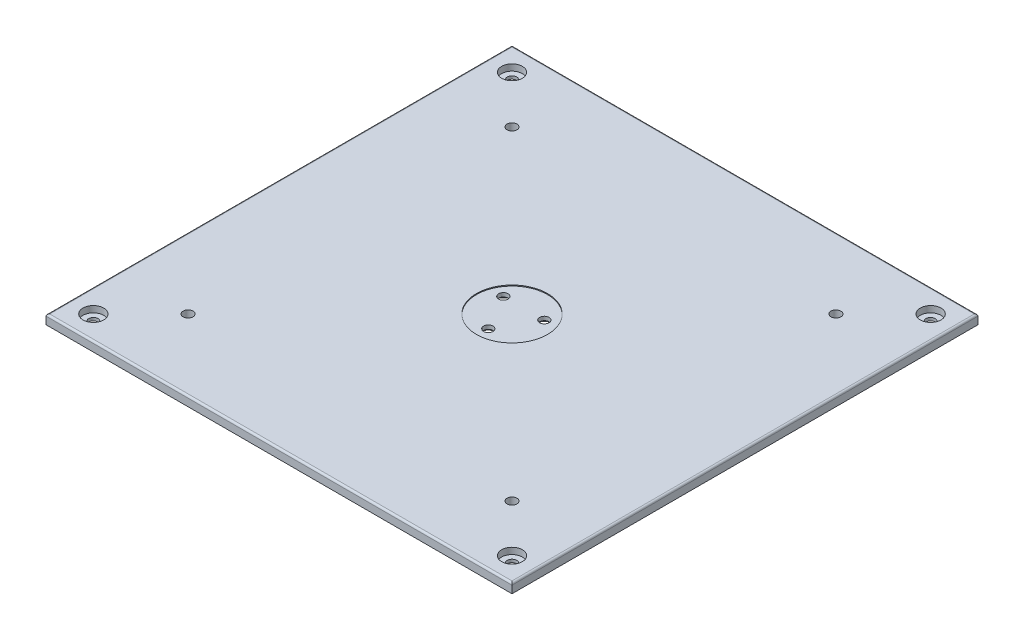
ISO-10303-21;
HEADER;
FILE_DESCRIPTION(('STEP AP214'),'2;1');
FILE_NAME('part.step','',(''),(''),'','','');
FILE_SCHEMA(('AUTOMOTIVE_DESIGN { 1 0 10303 214 1 1 1 1 }'));
ENDSEC;
DATA;
#1=APPLICATION_CONTEXT('core data for automotive mechanical design processes');
#2=APPLICATION_PROTOCOL_DEFINITION('international standard','automotive_design',2000,#1);
#3=PRODUCT_CONTEXT('',#1,'mechanical');
#4=PRODUCT('Part','Part','',(#3));
#5=PRODUCT_RELATED_PRODUCT_CATEGORY('part','',(#4));
#6=PRODUCT_DEFINITION_FORMATION('','',#4);
#7=PRODUCT_DEFINITION_CONTEXT('part definition',#1,'design');
#8=PRODUCT_DEFINITION('design','',#6,#7);
#9=PRODUCT_DEFINITION_SHAPE('','',#8);
#10=(LENGTH_UNIT() NAMED_UNIT(*) SI_UNIT(.MILLI.,.METRE.));
#11=(NAMED_UNIT(*) PLANE_ANGLE_UNIT() SI_UNIT($,.RADIAN.));
#12=(NAMED_UNIT(*) SI_UNIT($,.STERADIAN.) SOLID_ANGLE_UNIT());
#13=UNCERTAINTY_MEASURE_WITH_UNIT(LENGTH_MEASURE(1.E-05),#10,'distance_accuracy_value','');
#14=(GEOMETRIC_REPRESENTATION_CONTEXT(3) GLOBAL_UNCERTAINTY_ASSIGNED_CONTEXT((#13)) GLOBAL_UNIT_ASSIGNED_CONTEXT((#10,
#11,#12)) REPRESENTATION_CONTEXT('',''));
#15=CARTESIAN_POINT('',(0.,0.,0.));
#16=DIRECTION('',(0.,0.,1.));
#17=DIRECTION('',(1.,0.,0.));
#18=AXIS2_PLACEMENT_3D('',#15,#16,#17);
#19=CARTESIAN_POINT('',(-36.835700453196,10.,-26.4724532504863));
#20=DIRECTION('',(1.,0.,0.));
#21=DIRECTION('',(0.,0.,-1.));
#22=AXIS2_PLACEMENT_3D('',#19,#20,#21);
#23=PLANE('',#22);
#24=DIRECTION('',(0.,-1.,0.));
#25=VECTOR('',#24,1.);
#26=CARTESIAN_POINT('',(-36.8357004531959,10.,473.527546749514));
#27=LINE('',#26,#25);
#28=CARTESIAN_POINT('',(-36.8357004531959,8.,473.527546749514));
#29=VERTEX_POINT('',#28);
#30=CARTESIAN_POINT('',(-36.8357004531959,0.,473.527546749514));
#31=VERTEX_POINT('',#30);
#32=EDGE_CURVE('E88',#29,#31,#27,.T.);
#33=ORIENTED_EDGE('',*,*,#32,.F.);
#34=DIRECTION('',(0.,0.,1.));
#35=VECTOR('',#34,1.);
#36=CARTESIAN_POINT('',(-36.835700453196,8.,-26.4724532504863));
#37=LINE('',#36,#35);
#38=CARTESIAN_POINT('',(-36.835700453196,8.,-26.4724532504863));
#39=VERTEX_POINT('',#38);
#40=EDGE_CURVE('E135',#29,#39,#37,.F.);
#41=ORIENTED_EDGE('',*,*,#40,.T.);
#42=DIRECTION('',(0.,-1.,0.));
#43=VECTOR('',#42,1.);
#44=CARTESIAN_POINT('',(-36.835700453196,10.,-26.4724532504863));
#45=LINE('',#44,#43);
#46=CARTESIAN_POINT('',(-36.835700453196,0.,-26.4724532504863));
#47=VERTEX_POINT('',#46);
#48=EDGE_CURVE('E109',#39,#47,#45,.T.);
#49=ORIENTED_EDGE('',*,*,#48,.T.);
#50=DIRECTION('',(0.,0.,1.));
#51=VECTOR('',#50,1.);
#52=CARTESIAN_POINT('',(-36.835700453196,0.,-26.4724532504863));
#53=LINE('',#52,#51);
#54=EDGE_CURVE('E105',#47,#31,#53,.T.);
#55=ORIENTED_EDGE('',*,*,#54,.T.);
#56=EDGE_LOOP('',(#33,#41,#49,#55));
#57=FACE_BOUND('',#56,.T.);
#58=ADVANCED_FACE('F34',(#57),#23,.F.);
#59=CARTESIAN_POINT('',(-36.8357004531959,10.,473.527546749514));
#60=DIRECTION('',(0.,0.,-1.));
#61=DIRECTION('',(-1.,0.,0.));
#62=AXIS2_PLACEMENT_3D('',#59,#60,#61);
#63=PLANE('',#62);
#64=DIRECTION('',(0.,-1.,0.));
#65=VECTOR('',#64,1.);
#66=CARTESIAN_POINT('',(463.164299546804,10.,473.527546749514));
#67=LINE('',#66,#65);
#68=CARTESIAN_POINT('',(463.164299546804,8.,473.527546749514));
#69=VERTEX_POINT('',#68);
#70=CARTESIAN_POINT('',(463.164299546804,0.,473.527546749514));
#71=VERTEX_POINT('',#70);
#72=EDGE_CURVE('E99',#69,#71,#67,.T.);
#73=ORIENTED_EDGE('',*,*,#72,.F.);
#74=DIRECTION('',(1.,0.,0.));
#75=VECTOR('',#74,1.);
#76=CARTESIAN_POINT('',(-36.8357004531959,8.,473.527546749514));
#77=LINE('',#76,#75);
#78=EDGE_CURVE('E11',#69,#29,#77,.F.);
#79=ORIENTED_EDGE('',*,*,#78,.T.);
#80=ORIENTED_EDGE('',*,*,#32,.T.);
#81=DIRECTION('',(1.,0.,0.));
#82=VECTOR('',#81,1.);
#83=CARTESIAN_POINT('',(-36.8357004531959,0.,473.527546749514));
#84=LINE('',#83,#82);
#85=EDGE_CURVE('E91',#31,#71,#84,.T.);
#86=ORIENTED_EDGE('',*,*,#85,.T.);
#87=EDGE_LOOP('',(#73,#79,#80,#86));
#88=FACE_BOUND('',#87,.T.);
#89=ADVANCED_FACE('F90',(#88),#63,.F.);
#90=CARTESIAN_POINT('',(463.164299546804,10.,-26.4724532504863));
#91=DIRECTION('',(-1.,0.,0.));
#92=DIRECTION('',(0.,0.,1.));
#93=AXIS2_PLACEMENT_3D('',#90,#91,#92);
#94=PLANE('',#93);
#95=DIRECTION('',(0.,-1.,0.));
#96=VECTOR('',#95,1.);
#97=CARTESIAN_POINT('',(463.164299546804,10.,-26.4724532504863));
#98=LINE('',#97,#96);
#99=CARTESIAN_POINT('',(463.164299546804,8.,-26.4724532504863));
#100=VERTEX_POINT('',#99);
#101=CARTESIAN_POINT('',(463.164299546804,0.,-26.4724532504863));
#102=VERTEX_POINT('',#101);
#103=EDGE_CURVE('E124',#100,#102,#98,.T.);
#104=ORIENTED_EDGE('',*,*,#103,.F.);
#105=DIRECTION('',(0.,0.,-1.));
#106=VECTOR('',#105,1.);
#107=CARTESIAN_POINT('',(463.164299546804,8.,473.527546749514));
#108=LINE('',#107,#106);
#109=EDGE_CURVE('E43',#100,#69,#108,.F.);
#110=ORIENTED_EDGE('',*,*,#109,.T.);
#111=ORIENTED_EDGE('',*,*,#72,.T.);
#112=DIRECTION('',(0.,0.,-1.));
#113=VECTOR('',#112,1.);
#114=CARTESIAN_POINT('',(463.164299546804,0.,-26.4724532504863));
#115=LINE('',#114,#113);
#116=EDGE_CURVE('E107',#71,#102,#115,.T.);
#117=ORIENTED_EDGE('',*,*,#116,.T.);
#118=EDGE_LOOP('',(#104,#110,#111,#117));
#119=FACE_BOUND('',#118,.T.);
#120=ADVANCED_FACE('F208',(#119),#94,.F.);
#121=CARTESIAN_POINT('',(-36.835700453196,10.,-26.4724532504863));
#122=DIRECTION('',(0.,0.,1.));
#123=DIRECTION('',(1.,0.,0.));
#124=AXIS2_PLACEMENT_3D('',#121,#122,#123);
#125=PLANE('',#124);
#126=ORIENTED_EDGE('',*,*,#48,.F.);
#127=DIRECTION('',(-1.,0.,0.));
#128=VECTOR('',#127,1.);
#129=CARTESIAN_POINT('',(463.164299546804,8.,-26.4724532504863));
#130=LINE('',#129,#128);
#131=EDGE_CURVE('E58',#39,#100,#130,.F.);
#132=ORIENTED_EDGE('',*,*,#131,.T.);
#133=ORIENTED_EDGE('',*,*,#103,.T.);
#134=DIRECTION('',(-1.,0.,0.));
#135=VECTOR('',#134,1.);
#136=CARTESIAN_POINT('',(-36.835700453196,0.,-26.4724532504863));
#137=LINE('',#136,#135);
#138=EDGE_CURVE('E121',#102,#47,#137,.T.);
#139=ORIENTED_EDGE('',*,*,#138,.T.);
#140=EDGE_LOOP('',(#126,#132,#133,#139));
#141=FACE_BOUND('',#140,.T.);
#142=ADVANCED_FACE('F178',(#141),#125,.F.);
#143=CARTESIAN_POINT('',(-36.8357004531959,10.,473.527546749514));
#144=DIRECTION('',(0.,1.,0.));
#145=DIRECTION('',(0.,0.,1.));
#146=AXIS2_PLACEMENT_3D('',#143,#144,#145);
#147=PLANE('',#146);
#148=CARTESIAN_POINT('',(386.964299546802,10.,49.727546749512));
#149=DIRECTION('',(0.,1.,0.));
#150=DIRECTION('',(0.,0.,1.));
#151=AXIS2_PLACEMENT_3D('',#148,#149,#150);
#152=CIRCLE('',#151,5.35812999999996);
#153=CARTESIAN_POINT('',(386.964299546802,10.,55.085676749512));
#154=VERTEX_POINT('',#153);
#155=EDGE_CURVE('E521',#154,#154,#152,.T.);
#156=ORIENTED_EDGE('',*,*,#155,.F.);
#157=EDGE_LOOP('',(#156));
#158=FACE_BOUND('',#157,.T.);
#159=CARTESIAN_POINT('',(386.964299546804,10.,397.327546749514));
#160=DIRECTION('',(0.,1.,0.));
#161=DIRECTION('',(0.,0.,1.));
#162=AXIS2_PLACEMENT_3D('',#159,#160,#161);
#163=CIRCLE('',#162,5.35812999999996);
#164=CARTESIAN_POINT('',(386.964299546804,10.,402.685676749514));
#165=VERTEX_POINT('',#164);
#166=EDGE_CURVE('E523',#165,#165,#163,.T.);
#167=ORIENTED_EDGE('',*,*,#166,.F.);
#168=EDGE_LOOP('',(#167));
#169=FACE_BOUND('',#168,.T.);
#170=CARTESIAN_POINT('',(39.3642995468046,10.,397.327546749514));
#171=DIRECTION('',(0.,1.,0.));
#172=DIRECTION('',(0.,0.,1.));
#173=AXIS2_PLACEMENT_3D('',#170,#171,#172);
#174=CIRCLE('',#173,5.35812999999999);
#175=CARTESIAN_POINT('',(39.3642995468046,10.,402.685676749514));
#176=VERTEX_POINT('',#175);
#177=EDGE_CURVE('E531',#176,#176,#174,.T.);
#178=ORIENTED_EDGE('',*,*,#177,.F.);
#179=EDGE_LOOP('',(#178));
#180=FACE_BOUND('',#179,.T.);
#181=CARTESIAN_POINT('',(39.3642995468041,10.,49.7275467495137));
#182=DIRECTION('',(0.,1.,0.));
#183=DIRECTION('',(0.,0.,1.));
#184=AXIS2_PLACEMENT_3D('',#181,#182,#183);
#185=CIRCLE('',#184,5.35812999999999);
#186=CARTESIAN_POINT('',(39.3642995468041,10.,55.0856767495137));
#187=VERTEX_POINT('',#186);
#188=EDGE_CURVE('E537',#187,#187,#185,.T.);
#189=ORIENTED_EDGE('',*,*,#188,.F.);
#190=EDGE_LOOP('',(#189));
#191=FACE_BOUND('',#190,.T.);
#192=CARTESIAN_POINT('',(437.764299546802,10.,-1.07245325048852));
#193=DIRECTION('',(0.,1.,0.));
#194=DIRECTION('',(0.,0.,1.));
#195=AXIS2_PLACEMENT_3D('',#192,#193,#194);
#196=CIRCLE('',#195,11.1125);
#197=CARTESIAN_POINT('',(437.764299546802,10.,10.0400467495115));
#198=VERTEX_POINT('',#197);
#199=EDGE_CURVE('E543',#198,#198,#196,.T.);
#200=ORIENTED_EDGE('',*,*,#199,.F.);
#201=EDGE_LOOP('',(#200));
#202=FACE_BOUND('',#201,.T.);
#203=CARTESIAN_POINT('',(437.764299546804,10.,448.127546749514));
#204=DIRECTION('',(0.,1.,0.));
#205=DIRECTION('',(0.,0.,1.));
#206=AXIS2_PLACEMENT_3D('',#203,#204,#205);
#207=CIRCLE('',#206,11.1125);
#208=CARTESIAN_POINT('',(437.764299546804,10.,459.240046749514));
#209=VERTEX_POINT('',#208);
#210=EDGE_CURVE('E555',#209,#209,#207,.T.);
#211=ORIENTED_EDGE('',*,*,#210,.F.);
#212=EDGE_LOOP('',(#211));
#213=FACE_BOUND('',#212,.T.);
#214=CARTESIAN_POINT('',(-11.4357004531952,10.,448.127546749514));
#215=DIRECTION('',(0.,1.,0.));
#216=DIRECTION('',(0.,0.,1.));
#217=AXIS2_PLACEMENT_3D('',#214,#215,#216);
#218=CIRCLE('',#217,11.1125);
#219=CARTESIAN_POINT('',(-11.4357004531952,10.,459.240046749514));
#220=VERTEX_POINT('',#219);
#221=EDGE_CURVE('E567',#220,#220,#218,.T.);
#222=ORIENTED_EDGE('',*,*,#221,.F.);
#223=EDGE_LOOP('',(#222));
#224=FACE_BOUND('',#223,.T.);
#225=CARTESIAN_POINT('',(-11.4357004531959,10.,-1.07245325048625));
#226=DIRECTION('',(0.,1.,0.));
#227=DIRECTION('',(0.,0.,1.));
#228=AXIS2_PLACEMENT_3D('',#225,#226,#227);
#229=CIRCLE('',#228,11.1125);
#230=CARTESIAN_POINT('',(-11.4357004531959,10.,10.0400467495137));
#231=VERTEX_POINT('',#230);
#232=EDGE_CURVE('E579',#231,#231,#229,.T.);
#233=ORIENTED_EDGE('',*,*,#232,.F.);
#234=EDGE_LOOP('',(#233));
#235=FACE_BOUND('',#234,.T.);
#236=CARTESIAN_POINT('',(213.164299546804,10.,223.527546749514));
#237=DIRECTION('',(0.,1.,0.));
#238=DIRECTION('',(0.,0.,1.));
#239=AXIS2_PLACEMENT_3D('',#236,#237,#238);
#240=CIRCLE('',#239,38.1);
#241=CARTESIAN_POINT('',(213.164299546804,10.,261.627546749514));
#242=VERTEX_POINT('',#241);
#243=EDGE_CURVE('E117',#242,#242,#240,.T.);
#244=ORIENTED_EDGE('',*,*,#243,.F.);
#245=EDGE_LOOP('',(#244));
#246=FACE_BOUND('',#245,.T.);
#247=DIRECTION('',(-1.,0.,0.));
#248=VECTOR('',#247,1.);
#249=CARTESIAN_POINT('',(-36.835700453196,10.,-24.4724532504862));
#250=LINE('',#249,#248);
#251=CARTESIAN_POINT('',(461.164299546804,10.,-24.4724532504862));
#252=VERTEX_POINT('',#251);
#253=CARTESIAN_POINT('',(-34.835700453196,10.,-24.4724532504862));
#254=VERTEX_POINT('',#253);
#255=EDGE_CURVE('E130',#252,#254,#250,.T.);
#256=ORIENTED_EDGE('',*,*,#255,.T.);
#257=DIRECTION('',(0.,0.,1.));
#258=VECTOR('',#257,1.);
#259=CARTESIAN_POINT('',(-34.8357004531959,10.,473.527546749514));
#260=LINE('',#259,#258);
#261=CARTESIAN_POINT('',(-34.8357004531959,10.,471.527546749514));
#262=VERTEX_POINT('',#261);
#263=EDGE_CURVE('E132',#254,#262,#260,.T.);
#264=ORIENTED_EDGE('',*,*,#263,.T.);
#265=DIRECTION('',(1.,0.,0.));
#266=VECTOR('',#265,1.);
#267=CARTESIAN_POINT('',(463.164299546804,10.,471.527546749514));
#268=LINE('',#267,#266);
#269=CARTESIAN_POINT('',(461.164299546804,10.,471.527546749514));
#270=VERTEX_POINT('',#269);
#271=EDGE_CURVE('E98',#262,#270,#268,.T.);
#272=ORIENTED_EDGE('',*,*,#271,.T.);
#273=DIRECTION('',(0.,0.,-1.));
#274=VECTOR('',#273,1.);
#275=CARTESIAN_POINT('',(461.164299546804,10.,-26.4724532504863));
#276=LINE('',#275,#274);
#277=EDGE_CURVE('E128',#270,#252,#276,.T.);
#278=ORIENTED_EDGE('',*,*,#277,.T.);
#279=EDGE_LOOP('',(#256,#264,#272,#278));
#280=FACE_BOUND('',#279,.T.);
#281=ADVANCED_FACE('F175',(#158,#169,#180,#191,#202,#213,#224,#235,#246,#280),#147,.T.);
#282=CARTESIAN_POINT('',(-36.8357004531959,0.,473.527546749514));
#283=DIRECTION('',(0.,1.,0.));
#284=DIRECTION('',(0.,0.,1.));
#285=AXIS2_PLACEMENT_3D('',#282,#283,#284);
#286=PLANE('',#285);
#287=CARTESIAN_POINT('',(386.964299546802,0.,49.727546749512));
#288=DIRECTION('',(0.,1.,0.));
#289=DIRECTION('',(0.,0.,1.));
#290=AXIS2_PLACEMENT_3D('',#287,#288,#289);
#291=CIRCLE('',#290,5.35813000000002);
#292=CARTESIAN_POINT('',(386.964299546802,0.,55.085676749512));
#293=VERTEX_POINT('',#292);
#294=EDGE_CURVE('E518',#293,#293,#291,.T.);
#295=ORIENTED_EDGE('',*,*,#294,.T.);
#296=EDGE_LOOP('',(#295));
#297=FACE_BOUND('',#296,.T.);
#298=CARTESIAN_POINT('',(386.964299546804,0.,397.327546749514));
#299=DIRECTION('',(0.,1.,0.));
#300=DIRECTION('',(0.,0.,1.));
#301=AXIS2_PLACEMENT_3D('',#298,#299,#300);
#302=CIRCLE('',#301,5.35813000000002);
#303=CARTESIAN_POINT('',(386.964299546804,0.,402.685676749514));
#304=VERTEX_POINT('',#303);
#305=EDGE_CURVE('E528',#304,#304,#302,.T.);
#306=ORIENTED_EDGE('',*,*,#305,.T.);
#307=EDGE_LOOP('',(#306));
#308=FACE_BOUND('',#307,.T.);
#309=CARTESIAN_POINT('',(39.3642995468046,0.,397.327546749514));
#310=DIRECTION('',(0.,1.,0.));
#311=DIRECTION('',(0.,0.,1.));
#312=AXIS2_PLACEMENT_3D('',#309,#310,#311);
#313=CIRCLE('',#312,5.35813);
#314=CARTESIAN_POINT('',(39.3642995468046,0.,402.685676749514));
#315=VERTEX_POINT('',#314);
#316=EDGE_CURVE('E534',#315,#315,#313,.T.);
#317=ORIENTED_EDGE('',*,*,#316,.T.);
#318=EDGE_LOOP('',(#317));
#319=FACE_BOUND('',#318,.T.);
#320=CARTESIAN_POINT('',(39.3642995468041,0.,49.7275467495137));
#321=DIRECTION('',(0.,1.,0.));
#322=DIRECTION('',(0.,0.,1.));
#323=AXIS2_PLACEMENT_3D('',#320,#321,#322);
#324=CIRCLE('',#323,5.35813);
#325=CARTESIAN_POINT('',(39.3642995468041,0.,55.0856767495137));
#326=VERTEX_POINT('',#325);
#327=EDGE_CURVE('E540',#326,#326,#324,.T.);
#328=ORIENTED_EDGE('',*,*,#327,.T.);
#329=EDGE_LOOP('',(#328));
#330=FACE_BOUND('',#329,.T.);
#331=CARTESIAN_POINT('',(437.764299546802,0.,-1.07245325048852));
#332=DIRECTION('',(0.,1.,0.));
#333=DIRECTION('',(0.,0.,1.));
#334=AXIS2_PLACEMENT_3D('',#331,#332,#333);
#335=CIRCLE('',#334,5.04189999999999);
#336=CARTESIAN_POINT('',(437.764299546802,0.,3.96944674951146));
#337=VERTEX_POINT('',#336);
#338=EDGE_CURVE('E552',#337,#337,#335,.T.);
#339=ORIENTED_EDGE('',*,*,#338,.T.);
#340=EDGE_LOOP('',(#339));
#341=FACE_BOUND('',#340,.T.);
#342=CARTESIAN_POINT('',(437.764299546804,0.,448.127546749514));
#343=DIRECTION('',(0.,1.,0.));
#344=DIRECTION('',(0.,0.,1.));
#345=AXIS2_PLACEMENT_3D('',#342,#343,#344);
#346=CIRCLE('',#345,5.04189999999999);
#347=CARTESIAN_POINT('',(437.764299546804,0.,453.169446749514));
#348=VERTEX_POINT('',#347);
#349=EDGE_CURVE('E564',#348,#348,#346,.T.);
#350=ORIENTED_EDGE('',*,*,#349,.T.);
#351=EDGE_LOOP('',(#350));
#352=FACE_BOUND('',#351,.T.);
#353=CARTESIAN_POINT('',(-11.4357004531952,0.,448.127546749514));
#354=DIRECTION('',(0.,1.,0.));
#355=DIRECTION('',(0.,0.,1.));
#356=AXIS2_PLACEMENT_3D('',#353,#354,#355);
#357=CIRCLE('',#356,5.0419);
#358=CARTESIAN_POINT('',(-11.4357004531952,0.,453.169446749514));
#359=VERTEX_POINT('',#358);
#360=EDGE_CURVE('E576',#359,#359,#357,.T.);
#361=ORIENTED_EDGE('',*,*,#360,.T.);
#362=EDGE_LOOP('',(#361));
#363=FACE_BOUND('',#362,.T.);
#364=CARTESIAN_POINT('',(-11.4357004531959,0.,-1.07245325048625));
#365=DIRECTION('',(0.,1.,0.));
#366=DIRECTION('',(0.,0.,1.));
#367=AXIS2_PLACEMENT_3D('',#364,#365,#366);
#368=CIRCLE('',#367,5.0419);
#369=CARTESIAN_POINT('',(-11.4357004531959,0.,3.96944674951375));
#370=VERTEX_POINT('',#369);
#371=EDGE_CURVE('E588',#370,#370,#368,.T.);
#372=ORIENTED_EDGE('',*,*,#371,.T.);
#373=EDGE_LOOP('',(#372));
#374=FACE_BOUND('',#373,.T.);
#375=CARTESIAN_POINT('',(191.167254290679,0.,210.827546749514));
#376=DIRECTION('',(0.,-1.,0.));
#377=DIRECTION('',(0.,0.,-1.));
#378=AXIS2_PLACEMENT_3D('',#375,#376,#377);
#379=CIRCLE('',#378,10.8691553);
#380=CARTESIAN_POINT('',(191.167254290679,0.,199.958391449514));
#381=VERTEX_POINT('',#380);
#382=EDGE_CURVE('E591',#381,#381,#379,.T.);
#383=ORIENTED_EDGE('',*,*,#382,.F.);
#384=EDGE_LOOP('',(#383));
#385=FACE_BOUND('',#384,.T.);
#386=CARTESIAN_POINT('',(235.161344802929,0.,210.827546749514));
#387=DIRECTION('',(0.,-1.,0.));
#388=DIRECTION('',(0.,0.,-1.));
#389=AXIS2_PLACEMENT_3D('',#386,#387,#388);
#390=CIRCLE('',#389,10.8691553);
#391=CARTESIAN_POINT('',(235.161344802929,0.,199.958391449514));
#392=VERTEX_POINT('',#391);
#393=EDGE_CURVE('E158',#392,#392,#390,.T.);
#394=ORIENTED_EDGE('',*,*,#393,.F.);
#395=EDGE_LOOP('',(#394));
#396=FACE_BOUND('',#395,.T.);
#397=CARTESIAN_POINT('',(213.164299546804,0.,248.927546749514));
#398=DIRECTION('',(0.,-1.,0.));
#399=DIRECTION('',(0.,0.,-1.));
#400=AXIS2_PLACEMENT_3D('',#397,#398,#399);
#401=CIRCLE('',#400,10.8691553);
#402=CARTESIAN_POINT('',(213.164299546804,0.,238.058391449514));
#403=VERTEX_POINT('',#402);
#404=EDGE_CURVE('E151',#403,#403,#401,.T.);
#405=ORIENTED_EDGE('',*,*,#404,.F.);
#406=EDGE_LOOP('',(#405));
#407=FACE_BOUND('',#406,.T.);
#408=ORIENTED_EDGE('',*,*,#54,.F.);
#409=ORIENTED_EDGE('',*,*,#138,.F.);
#410=ORIENTED_EDGE('',*,*,#116,.F.);
#411=ORIENTED_EDGE('',*,*,#85,.F.);
#412=EDGE_LOOP('',(#408,#409,#410,#411));
#413=FACE_BOUND('',#412,.T.);
#414=ADVANCED_FACE('F103',(#297,#308,#319,#330,#341,#352,#363,#374,#385,#396,#407,#413),#286,.F.);
#415=CARTESIAN_POINT('',(461.164299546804,8.,473.527546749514));
#416=DIRECTION('',(0.,0.,1.));
#417=DIRECTION('',(1.,0.,0.));
#418=AXIS2_PLACEMENT_3D('',#415,#416,#417);
#419=CYLINDRICAL_SURFACE('',#418,2.);
#420=CARTESIAN_POINT('',(461.164299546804,8.,471.527546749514));
#421=DIRECTION('',(-0.707106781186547,0.,0.707106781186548));
#422=DIRECTION('',(-0.707106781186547,0.,-0.707106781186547));
#423=AXIS2_PLACEMENT_3D('',#420,#421,#422);
#424=ELLIPSE('',#423,2.82842712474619,2.);
#425=EDGE_CURVE('E114',#69,#270,#424,.T.);
#426=ORIENTED_EDGE('',*,*,#425,.F.);
#427=ORIENTED_EDGE('',*,*,#109,.F.);
#428=CARTESIAN_POINT('',(461.164299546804,8.,-24.4724532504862));
#429=DIRECTION('',(0.707106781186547,0.,0.707106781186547));
#430=DIRECTION('',(-0.707106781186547,0.,0.707106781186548));
#431=AXIS2_PLACEMENT_3D('',#428,#429,#430);
#432=ELLIPSE('',#431,2.82842712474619,2.);
#433=EDGE_CURVE('E111',#252,#100,#432,.F.);
#434=ORIENTED_EDGE('',*,*,#433,.F.);
#435=ORIENTED_EDGE('',*,*,#277,.F.);
#436=EDGE_LOOP('',(#426,#427,#434,#435));
#437=FACE_BOUND('',#436,.T.);
#438=ADVANCED_FACE('F36',(#437),#419,.T.);
#439=CARTESIAN_POINT('',(-36.8357004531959,8.,-24.4724532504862));
#440=DIRECTION('',(1.,0.,0.));
#441=DIRECTION('',(0.,0.,-1.));
#442=AXIS2_PLACEMENT_3D('',#439,#440,#441);
#443=CYLINDRICAL_SURFACE('',#442,2.);
#444=ORIENTED_EDGE('',*,*,#433,.T.);
#445=ORIENTED_EDGE('',*,*,#131,.F.);
#446=CARTESIAN_POINT('',(-34.835700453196,8.,-24.4724532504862));
#447=DIRECTION('',(0.707106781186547,0.,-0.707106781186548));
#448=DIRECTION('',(0.707106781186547,0.,0.707106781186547));
#449=AXIS2_PLACEMENT_3D('',#446,#447,#448);
#450=ELLIPSE('',#449,2.82842712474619,2.);
#451=EDGE_CURVE('E141',#254,#39,#450,.F.);
#452=ORIENTED_EDGE('',*,*,#451,.F.);
#453=ORIENTED_EDGE('',*,*,#255,.F.);
#454=EDGE_LOOP('',(#444,#445,#452,#453));
#455=FACE_BOUND('',#454,.T.);
#456=ADVANCED_FACE('F187',(#455),#443,.T.);
#457=CARTESIAN_POINT('',(-36.8357004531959,8.,471.527546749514));
#458=DIRECTION('',(-1.,0.,0.));
#459=DIRECTION('',(0.,0.,1.));
#460=AXIS2_PLACEMENT_3D('',#457,#458,#459);
#461=CYLINDRICAL_SURFACE('',#460,2.);
#462=ORIENTED_EDGE('',*,*,#425,.T.);
#463=ORIENTED_EDGE('',*,*,#271,.F.);
#464=CARTESIAN_POINT('',(-34.8357004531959,8.,471.527546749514));
#465=DIRECTION('',(-0.707106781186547,0.,-0.707106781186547));
#466=DIRECTION('',(-0.707106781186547,0.,0.707106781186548));
#467=AXIS2_PLACEMENT_3D('',#464,#465,#466);
#468=ELLIPSE('',#467,2.82842712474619,2.);
#469=EDGE_CURVE('E139',#29,#262,#468,.T.);
#470=ORIENTED_EDGE('',*,*,#469,.F.);
#471=ORIENTED_EDGE('',*,*,#78,.F.);
#472=EDGE_LOOP('',(#462,#463,#470,#471));
#473=FACE_BOUND('',#472,.T.);
#474=ADVANCED_FACE('F193',(#473),#461,.T.);
#475=CARTESIAN_POINT('',(-34.8357004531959,8.,473.527546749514));
#476=DIRECTION('',(0.,0.,-1.));
#477=DIRECTION('',(-1.,0.,0.));
#478=AXIS2_PLACEMENT_3D('',#475,#476,#477);
#479=CYLINDRICAL_SURFACE('',#478,2.);
#480=ORIENTED_EDGE('',*,*,#451,.T.);
#481=ORIENTED_EDGE('',*,*,#40,.F.);
#482=ORIENTED_EDGE('',*,*,#469,.T.);
#483=ORIENTED_EDGE('',*,*,#263,.F.);
#484=EDGE_LOOP('',(#480,#481,#482,#483));
#485=FACE_BOUND('',#484,.T.);
#486=ADVANCED_FACE('F189',(#485),#479,.T.);
#487=CARTESIAN_POINT('',(213.164299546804,9.,223.527546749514));
#488=DIRECTION('',(0.,1.,0.));
#489=DIRECTION('',(0.,0.,1.));
#490=AXIS2_PLACEMENT_3D('',#487,#488,#489);
#491=CYLINDRICAL_SURFACE('',#490,38.1);
#492=CARTESIAN_POINT('',(213.164299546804,9.,223.527546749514));
#493=DIRECTION('',(0.,1.,0.));
#494=DIRECTION('',(0.,0.,1.));
#495=AXIS2_PLACEMENT_3D('',#492,#493,#494);
#496=CIRCLE('',#495,38.1);
#497=CARTESIAN_POINT('',(213.164299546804,9.,261.627546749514));
#498=VERTEX_POINT('',#497);
#499=EDGE_CURVE('E142',#498,#498,#496,.T.);
#500=ORIENTED_EDGE('',*,*,#499,.F.);
#501=EDGE_LOOP('',(#500));
#502=FACE_BOUND('',#501,.T.);
#503=ORIENTED_EDGE('',*,*,#243,.T.);
#504=EDGE_LOOP('',(#503));
#505=FACE_BOUND('',#504,.T.);
#506=ADVANCED_FACE('F173',(#502,#505),#491,.F.);
#507=CARTESIAN_POINT('',(213.164299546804,9.,223.527546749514));
#508=DIRECTION('',(0.,1.,0.));
#509=DIRECTION('',(0.,0.,1.));
#510=AXIS2_PLACEMENT_3D('',#507,#508,#509);
#511=PLANE('',#510);
#512=CARTESIAN_POINT('',(191.167254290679,9.,210.827546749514));
#513=DIRECTION('',(0.,1.,0.));
#514=DIRECTION('',(0.,0.,1.));
#515=AXIS2_PLACEMENT_3D('',#512,#513,#514);
#516=CIRCLE('',#515,5.04189999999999);
#517=CARTESIAN_POINT('',(191.167254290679,9.,215.869446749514));
#518=VERTEX_POINT('',#517);
#519=EDGE_CURVE('E38',#518,#518,#516,.T.);
#520=ORIENTED_EDGE('',*,*,#519,.F.);
#521=EDGE_LOOP('',(#520));
#522=FACE_BOUND('',#521,.T.);
#523=CARTESIAN_POINT('',(235.161344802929,9.,210.827546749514));
#524=DIRECTION('',(0.,1.,0.));
#525=DIRECTION('',(0.,0.,1.));
#526=AXIS2_PLACEMENT_3D('',#523,#524,#525);
#527=CIRCLE('',#526,5.04189999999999);
#528=CARTESIAN_POINT('',(235.161344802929,9.,215.869446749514));
#529=VERTEX_POINT('',#528);
#530=EDGE_CURVE('E149',#529,#529,#527,.T.);
#531=ORIENTED_EDGE('',*,*,#530,.F.);
#532=EDGE_LOOP('',(#531));
#533=FACE_BOUND('',#532,.T.);
#534=CARTESIAN_POINT('',(213.164299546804,9.,248.927546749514));
#535=DIRECTION('',(0.,1.,0.));
#536=DIRECTION('',(0.,0.,1.));
#537=AXIS2_PLACEMENT_3D('',#534,#535,#536);
#538=CIRCLE('',#537,5.04189999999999);
#539=CARTESIAN_POINT('',(213.164299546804,9.,253.969446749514));
#540=VERTEX_POINT('',#539);
#541=EDGE_CURVE('E146',#540,#540,#538,.T.);
#542=ORIENTED_EDGE('',*,*,#541,.F.);
#543=EDGE_LOOP('',(#542));
#544=FACE_BOUND('',#543,.T.);
#545=ORIENTED_EDGE('',*,*,#499,.T.);
#546=EDGE_LOOP('',(#545));
#547=FACE_BOUND('',#546,.T.);
#548=ADVANCED_FACE('F229',(#522,#533,#544,#547),#511,.T.);
#549=CARTESIAN_POINT('',(213.164299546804,0.,248.927546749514));
#550=DIRECTION('',(0.,-1.,0.));
#551=DIRECTION('',(0.,0.,-1.));
#552=AXIS2_PLACEMENT_3D('',#549,#550,#551);
#553=CYLINDRICAL_SURFACE('',#552,5.04189999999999);
#554=ORIENTED_EDGE('',*,*,#541,.T.);
#555=EDGE_LOOP('',(#554));
#556=FACE_BOUND('',#555,.T.);
#557=CARTESIAN_POINT('',(213.164299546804,4.88964777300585,248.927546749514));
#558=DIRECTION('',(0.,-1.,0.));
#559=DIRECTION('',(0.,0.,-1.));
#560=AXIS2_PLACEMENT_3D('',#557,#558,#559);
#561=CIRCLE('',#560,5.04189999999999);
#562=CARTESIAN_POINT('',(213.164299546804,4.88964777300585,243.885646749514));
#563=VERTEX_POINT('',#562);
#564=EDGE_CURVE('E148',#563,#563,#561,.T.);
#565=ORIENTED_EDGE('',*,*,#564,.T.);
#566=EDGE_LOOP('',(#565));
#567=FACE_BOUND('',#566,.T.);
#568=ADVANCED_FACE('F238',(#556,#567),#553,.F.);
#569=CARTESIAN_POINT('',(213.164299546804,0.,248.927546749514));
#570=DIRECTION('',(0.,-1.,0.));
#571=DIRECTION('',(0.,0.,-1.));
#572=AXIS2_PLACEMENT_3D('',#569,#570,#571);
#573=CONICAL_SURFACE('',#572,10.8691553,0.872664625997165);
#574=ORIENTED_EDGE('',*,*,#564,.F.);
#575=EDGE_LOOP('',(#574));
#576=FACE_BOUND('',#575,.T.);
#577=ORIENTED_EDGE('',*,*,#404,.T.);
#578=EDGE_LOOP('',(#577));
#579=FACE_BOUND('',#578,.T.);
#580=ADVANCED_FACE('F247',(#576,#579),#573,.F.);
#581=CARTESIAN_POINT('',(235.161344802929,0.,210.827546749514));
#582=DIRECTION('',(0.,-1.,0.));
#583=DIRECTION('',(0.,0.,-1.));
#584=AXIS2_PLACEMENT_3D('',#581,#582,#583);
#585=CYLINDRICAL_SURFACE('',#584,5.04189999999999);
#586=ORIENTED_EDGE('',*,*,#530,.T.);
#587=EDGE_LOOP('',(#586));
#588=FACE_BOUND('',#587,.T.);
#589=CARTESIAN_POINT('',(235.161344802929,4.88964777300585,210.827546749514));
#590=DIRECTION('',(0.,-1.,0.));
#591=DIRECTION('',(0.,0.,-1.));
#592=AXIS2_PLACEMENT_3D('',#589,#590,#591);
#593=CIRCLE('',#592,5.04189999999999);
#594=CARTESIAN_POINT('',(235.161344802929,4.88964777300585,205.785646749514));
#595=VERTEX_POINT('',#594);
#596=EDGE_CURVE('E152',#595,#595,#593,.T.);
#597=ORIENTED_EDGE('',*,*,#596,.T.);
#598=EDGE_LOOP('',(#597));
#599=FACE_BOUND('',#598,.T.);
#600=ADVANCED_FACE('F254',(#588,#599),#585,.F.);
#601=CARTESIAN_POINT('',(235.161344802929,0.,210.827546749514));
#602=DIRECTION('',(0.,-1.,0.));
#603=DIRECTION('',(0.,0.,-1.));
#604=AXIS2_PLACEMENT_3D('',#601,#602,#603);
#605=CONICAL_SURFACE('',#604,10.8691553,0.872664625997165);
#606=ORIENTED_EDGE('',*,*,#596,.F.);
#607=EDGE_LOOP('',(#606));
#608=FACE_BOUND('',#607,.T.);
#609=ORIENTED_EDGE('',*,*,#393,.T.);
#610=EDGE_LOOP('',(#609));
#611=FACE_BOUND('',#610,.T.);
#612=ADVANCED_FACE('F261',(#608,#611),#605,.F.);
#613=CARTESIAN_POINT('',(191.167254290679,0.,210.827546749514));
#614=DIRECTION('',(0.,-1.,0.));
#615=DIRECTION('',(0.,0.,-1.));
#616=AXIS2_PLACEMENT_3D('',#613,#614,#615);
#617=CYLINDRICAL_SURFACE('',#616,5.04189999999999);
#618=ORIENTED_EDGE('',*,*,#519,.T.);
#619=EDGE_LOOP('',(#618));
#620=FACE_BOUND('',#619,.T.);
#621=CARTESIAN_POINT('',(191.167254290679,4.88964777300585,210.827546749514));
#622=DIRECTION('',(0.,-1.,0.));
#623=DIRECTION('',(0.,0.,-1.));
#624=AXIS2_PLACEMENT_3D('',#621,#622,#623);
#625=CIRCLE('',#624,5.04189999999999);
#626=CARTESIAN_POINT('',(191.167254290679,4.88964777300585,205.785646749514));
#627=VERTEX_POINT('',#626);
#628=EDGE_CURVE('E593',#627,#627,#625,.T.);
#629=ORIENTED_EDGE('',*,*,#628,.T.);
#630=EDGE_LOOP('',(#629));
#631=FACE_BOUND('',#630,.T.);
#632=ADVANCED_FACE('F268',(#620,#631),#617,.F.);
#633=CARTESIAN_POINT('',(191.167254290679,0.,210.827546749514));
#634=DIRECTION('',(0.,-1.,0.));
#635=DIRECTION('',(0.,0.,-1.));
#636=AXIS2_PLACEMENT_3D('',#633,#634,#635);
#637=CONICAL_SURFACE('',#636,10.8691553,0.872664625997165);
#638=ORIENTED_EDGE('',*,*,#628,.F.);
#639=EDGE_LOOP('',(#638));
#640=FACE_BOUND('',#639,.T.);
#641=ORIENTED_EDGE('',*,*,#382,.T.);
#642=EDGE_LOOP('',(#641));
#643=FACE_BOUND('',#642,.T.);
#644=ADVANCED_FACE('F276',(#640,#643),#637,.F.);
#645=CARTESIAN_POINT('',(-11.4357004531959,10.,-1.07245325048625));
#646=DIRECTION('',(0.,1.,0.));
#647=DIRECTION('',(0.,0.,1.));
#648=AXIS2_PLACEMENT_3D('',#645,#646,#647);
#649=CYLINDRICAL_SURFACE('',#648,5.0419);
#650=ORIENTED_EDGE('',*,*,#371,.F.);
#651=EDGE_LOOP('',(#650));
#652=FACE_BOUND('',#651,.T.);
#653=CARTESIAN_POINT('',(-11.4357004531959,3.1928,-1.07245325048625));
#654=DIRECTION('',(0.,1.,0.));
#655=DIRECTION('',(0.,0.,1.));
#656=AXIS2_PLACEMENT_3D('',#653,#654,#655);
#657=CIRCLE('',#656,5.0419);
#658=CARTESIAN_POINT('',(-11.4357004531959,3.1928,3.96944674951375));
#659=VERTEX_POINT('',#658);
#660=EDGE_CURVE('E585',#659,#659,#657,.T.);
#661=ORIENTED_EDGE('',*,*,#660,.T.);
#662=EDGE_LOOP('',(#661));
#663=FACE_BOUND('',#662,.T.);
#664=ADVANCED_FACE('F284',(#652,#663),#649,.F.);
#665=CARTESIAN_POINT('',(-6.39380045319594,3.1928,-1.07245325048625));
#666=DIRECTION('',(0.,-1.,0.));
#667=DIRECTION('',(0.,0.,-1.));
#668=AXIS2_PLACEMENT_3D('',#665,#666,#667);
#669=PLANE('',#668);
#670=ORIENTED_EDGE('',*,*,#660,.F.);
#671=EDGE_LOOP('',(#670));
#672=FACE_BOUND('',#671,.T.);
#673=CARTESIAN_POINT('',(-11.4357004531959,3.1928,-1.07245325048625));
#674=DIRECTION('',(0.,1.,0.));
#675=DIRECTION('',(0.,0.,1.));
#676=AXIS2_PLACEMENT_3D('',#673,#674,#675);
#677=CIRCLE('',#676,11.1125);
#678=CARTESIAN_POINT('',(-11.4357004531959,3.1928,10.0400467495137));
#679=VERTEX_POINT('',#678);
#680=EDGE_CURVE('E582',#679,#679,#677,.T.);
#681=ORIENTED_EDGE('',*,*,#680,.T.);
#682=EDGE_LOOP('',(#681));
#683=FACE_BOUND('',#682,.T.);
#684=ADVANCED_FACE('F292',(#672,#683),#669,.F.);
#685=CARTESIAN_POINT('',(-11.4357004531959,10.,-1.07245325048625));
#686=DIRECTION('',(0.,1.,0.));
#687=DIRECTION('',(0.,0.,1.));
#688=AXIS2_PLACEMENT_3D('',#685,#686,#687);
#689=CYLINDRICAL_SURFACE('',#688,11.1125);
#690=ORIENTED_EDGE('',*,*,#680,.F.);
#691=EDGE_LOOP('',(#690));
#692=FACE_BOUND('',#691,.T.);
#693=ORIENTED_EDGE('',*,*,#232,.T.);
#694=EDGE_LOOP('',(#693));
#695=FACE_BOUND('',#694,.T.);
#696=ADVANCED_FACE('F300',(#692,#695),#689,.F.);
#697=CARTESIAN_POINT('',(-11.4357004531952,10.,448.127546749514));
#698=DIRECTION('',(0.,1.,0.));
#699=DIRECTION('',(0.,0.,1.));
#700=AXIS2_PLACEMENT_3D('',#697,#698,#699);
#701=CYLINDRICAL_SURFACE('',#700,5.0419);
#702=ORIENTED_EDGE('',*,*,#360,.F.);
#703=EDGE_LOOP('',(#702));
#704=FACE_BOUND('',#703,.T.);
#705=CARTESIAN_POINT('',(-11.4357004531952,3.1928,448.127546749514));
#706=DIRECTION('',(0.,1.,0.));
#707=DIRECTION('',(0.,0.,1.));
#708=AXIS2_PLACEMENT_3D('',#705,#706,#707);
#709=CIRCLE('',#708,5.0419);
#710=CARTESIAN_POINT('',(-11.4357004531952,3.1928,453.169446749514));
#711=VERTEX_POINT('',#710);
#712=EDGE_CURVE('E573',#711,#711,#709,.T.);
#713=ORIENTED_EDGE('',*,*,#712,.T.);
#714=EDGE_LOOP('',(#713));
#715=FACE_BOUND('',#714,.T.);
#716=ADVANCED_FACE('F308',(#704,#715),#701,.F.);
#717=CARTESIAN_POINT('',(-6.39380045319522,3.1928,448.127546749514));
#718=DIRECTION('',(0.,-1.,0.));
#719=DIRECTION('',(0.,0.,-1.));
#720=AXIS2_PLACEMENT_3D('',#717,#718,#719);
#721=PLANE('',#720);
#722=ORIENTED_EDGE('',*,*,#712,.F.);
#723=EDGE_LOOP('',(#722));
#724=FACE_BOUND('',#723,.T.);
#725=CARTESIAN_POINT('',(-11.4357004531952,3.1928,448.127546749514));
#726=DIRECTION('',(0.,1.,0.));
#727=DIRECTION('',(0.,0.,1.));
#728=AXIS2_PLACEMENT_3D('',#725,#726,#727);
#729=CIRCLE('',#728,11.1125);
#730=CARTESIAN_POINT('',(-11.4357004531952,3.1928,459.240046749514));
#731=VERTEX_POINT('',#730);
#732=EDGE_CURVE('E570',#731,#731,#729,.T.);
#733=ORIENTED_EDGE('',*,*,#732,.T.);
#734=EDGE_LOOP('',(#733));
#735=FACE_BOUND('',#734,.T.);
#736=ADVANCED_FACE('F316',(#724,#735),#721,.F.);
#737=CARTESIAN_POINT('',(-11.4357004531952,10.,448.127546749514));
#738=DIRECTION('',(0.,1.,0.));
#739=DIRECTION('',(0.,0.,1.));
#740=AXIS2_PLACEMENT_3D('',#737,#738,#739);
#741=CYLINDRICAL_SURFACE('',#740,11.1125);
#742=ORIENTED_EDGE('',*,*,#732,.F.);
#743=EDGE_LOOP('',(#742));
#744=FACE_BOUND('',#743,.T.);
#745=ORIENTED_EDGE('',*,*,#221,.T.);
#746=EDGE_LOOP('',(#745));
#747=FACE_BOUND('',#746,.T.);
#748=ADVANCED_FACE('F324',(#744,#747),#741,.F.);
#749=CARTESIAN_POINT('',(437.764299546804,10.,448.127546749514));
#750=DIRECTION('',(0.,1.,0.));
#751=DIRECTION('',(0.,0.,1.));
#752=AXIS2_PLACEMENT_3D('',#749,#750,#751);
#753=CYLINDRICAL_SURFACE('',#752,5.04189999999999);
#754=ORIENTED_EDGE('',*,*,#349,.F.);
#755=EDGE_LOOP('',(#754));
#756=FACE_BOUND('',#755,.T.);
#757=CARTESIAN_POINT('',(437.764299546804,3.1928,448.127546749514));
#758=DIRECTION('',(0.,1.,0.));
#759=DIRECTION('',(0.,0.,1.));
#760=AXIS2_PLACEMENT_3D('',#757,#758,#759);
#761=CIRCLE('',#760,5.04189999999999);
#762=CARTESIAN_POINT('',(437.764299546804,3.1928,453.169446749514));
#763=VERTEX_POINT('',#762);
#764=EDGE_CURVE('E561',#763,#763,#761,.T.);
#765=ORIENTED_EDGE('',*,*,#764,.T.);
#766=EDGE_LOOP('',(#765));
#767=FACE_BOUND('',#766,.T.);
#768=ADVANCED_FACE('F332',(#756,#767),#753,.F.);
#769=CARTESIAN_POINT('',(442.806199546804,3.1928,448.127546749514));
#770=DIRECTION('',(0.,-1.,0.));
#771=DIRECTION('',(0.,0.,-1.));
#772=AXIS2_PLACEMENT_3D('',#769,#770,#771);
#773=PLANE('',#772);
#774=ORIENTED_EDGE('',*,*,#764,.F.);
#775=EDGE_LOOP('',(#774));
#776=FACE_BOUND('',#775,.T.);
#777=CARTESIAN_POINT('',(437.764299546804,3.1928,448.127546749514));
#778=DIRECTION('',(0.,1.,0.));
#779=DIRECTION('',(0.,0.,1.));
#780=AXIS2_PLACEMENT_3D('',#777,#778,#779);
#781=CIRCLE('',#780,11.1125);
#782=CARTESIAN_POINT('',(437.764299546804,3.1928,459.240046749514));
#783=VERTEX_POINT('',#782);
#784=EDGE_CURVE('E558',#783,#783,#781,.T.);
#785=ORIENTED_EDGE('',*,*,#784,.T.);
#786=EDGE_LOOP('',(#785));
#787=FACE_BOUND('',#786,.T.);
#788=ADVANCED_FACE('F340',(#776,#787),#773,.F.);
#789=CARTESIAN_POINT('',(437.764299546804,10.,448.127546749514));
#790=DIRECTION('',(0.,1.,0.));
#791=DIRECTION('',(0.,0.,1.));
#792=AXIS2_PLACEMENT_3D('',#789,#790,#791);
#793=CYLINDRICAL_SURFACE('',#792,11.1125);
#794=ORIENTED_EDGE('',*,*,#784,.F.);
#795=EDGE_LOOP('',(#794));
#796=FACE_BOUND('',#795,.T.);
#797=ORIENTED_EDGE('',*,*,#210,.T.);
#798=EDGE_LOOP('',(#797));
#799=FACE_BOUND('',#798,.T.);
#800=ADVANCED_FACE('F348',(#796,#799),#793,.F.);
#801=CARTESIAN_POINT('',(437.764299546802,10.,-1.07245325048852));
#802=DIRECTION('',(0.,1.,0.));
#803=DIRECTION('',(0.,0.,1.));
#804=AXIS2_PLACEMENT_3D('',#801,#802,#803);
#805=CYLINDRICAL_SURFACE('',#804,5.04189999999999);
#806=ORIENTED_EDGE('',*,*,#338,.F.);
#807=EDGE_LOOP('',(#806));
#808=FACE_BOUND('',#807,.T.);
#809=CARTESIAN_POINT('',(437.764299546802,3.1928,-1.07245325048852));
#810=DIRECTION('',(0.,1.,0.));
#811=DIRECTION('',(0.,0.,1.));
#812=AXIS2_PLACEMENT_3D('',#809,#810,#811);
#813=CIRCLE('',#812,5.04189999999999);
#814=CARTESIAN_POINT('',(437.764299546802,3.1928,3.96944674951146));
#815=VERTEX_POINT('',#814);
#816=EDGE_CURVE('E549',#815,#815,#813,.T.);
#817=ORIENTED_EDGE('',*,*,#816,.T.);
#818=EDGE_LOOP('',(#817));
#819=FACE_BOUND('',#818,.T.);
#820=ADVANCED_FACE('F356',(#808,#819),#805,.F.);
#821=CARTESIAN_POINT('',(442.806199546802,3.1928,-1.07245325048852));
#822=DIRECTION('',(0.,-1.,0.));
#823=DIRECTION('',(0.,0.,-1.));
#824=AXIS2_PLACEMENT_3D('',#821,#822,#823);
#825=PLANE('',#824);
#826=ORIENTED_EDGE('',*,*,#816,.F.);
#827=EDGE_LOOP('',(#826));
#828=FACE_BOUND('',#827,.T.);
#829=CARTESIAN_POINT('',(437.764299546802,3.1928,-1.07245325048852));
#830=DIRECTION('',(0.,1.,0.));
#831=DIRECTION('',(0.,0.,1.));
#832=AXIS2_PLACEMENT_3D('',#829,#830,#831);
#833=CIRCLE('',#832,11.1125);
#834=CARTESIAN_POINT('',(437.764299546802,3.1928,10.0400467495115));
#835=VERTEX_POINT('',#834);
#836=EDGE_CURVE('E546',#835,#835,#833,.T.);
#837=ORIENTED_EDGE('',*,*,#836,.T.);
#838=EDGE_LOOP('',(#837));
#839=FACE_BOUND('',#838,.T.);
#840=ADVANCED_FACE('F364',(#828,#839),#825,.F.);
#841=CARTESIAN_POINT('',(437.764299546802,10.,-1.07245325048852));
#842=DIRECTION('',(0.,1.,0.));
#843=DIRECTION('',(0.,0.,1.));
#844=AXIS2_PLACEMENT_3D('',#841,#842,#843);
#845=CYLINDRICAL_SURFACE('',#844,11.1125);
#846=ORIENTED_EDGE('',*,*,#836,.F.);
#847=EDGE_LOOP('',(#846));
#848=FACE_BOUND('',#847,.T.);
#849=ORIENTED_EDGE('',*,*,#199,.T.);
#850=EDGE_LOOP('',(#849));
#851=FACE_BOUND('',#850,.T.);
#852=ADVANCED_FACE('F372',(#848,#851),#845,.F.);
#853=CARTESIAN_POINT('',(39.3642995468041,10.,49.7275467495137));
#854=DIRECTION('',(0.,1.,0.));
#855=DIRECTION('',(0.,0.,1.));
#856=AXIS2_PLACEMENT_3D('',#853,#854,#855);
#857=CYLINDRICAL_SURFACE('',#856,5.35812999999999);
#858=ORIENTED_EDGE('',*,*,#327,.F.);
#859=EDGE_LOOP('',(#858));
#860=FACE_BOUND('',#859,.T.);
#861=ORIENTED_EDGE('',*,*,#188,.T.);
#862=EDGE_LOOP('',(#861));
#863=FACE_BOUND('',#862,.T.);
#864=ADVANCED_FACE('F380',(#860,#863),#857,.F.);
#865=CARTESIAN_POINT('',(39.3642995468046,10.,397.327546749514));
#866=DIRECTION('',(0.,1.,0.));
#867=DIRECTION('',(0.,0.,1.));
#868=AXIS2_PLACEMENT_3D('',#865,#866,#867);
#869=CYLINDRICAL_SURFACE('',#868,5.35812999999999);
#870=ORIENTED_EDGE('',*,*,#316,.F.);
#871=EDGE_LOOP('',(#870));
#872=FACE_BOUND('',#871,.T.);
#873=ORIENTED_EDGE('',*,*,#177,.T.);
#874=EDGE_LOOP('',(#873));
#875=FACE_BOUND('',#874,.T.);
#876=ADVANCED_FACE('F389',(#872,#875),#869,.F.);
#877=CARTESIAN_POINT('',(386.964299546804,10.,397.327546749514));
#878=DIRECTION('',(0.,1.,0.));
#879=DIRECTION('',(0.,0.,1.));
#880=AXIS2_PLACEMENT_3D('',#877,#878,#879);
#881=CYLINDRICAL_SURFACE('',#880,5.35812999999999);
#882=ORIENTED_EDGE('',*,*,#305,.F.);
#883=EDGE_LOOP('',(#882));
#884=FACE_BOUND('',#883,.T.);
#885=ORIENTED_EDGE('',*,*,#166,.T.);
#886=EDGE_LOOP('',(#885));
#887=FACE_BOUND('',#886,.T.);
#888=ADVANCED_FACE('F397',(#884,#887),#881,.F.);
#889=CARTESIAN_POINT('',(386.964299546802,10.,49.727546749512));
#890=DIRECTION('',(0.,1.,0.));
#891=DIRECTION('',(0.,0.,1.));
#892=AXIS2_PLACEMENT_3D('',#889,#890,#891);
#893=CYLINDRICAL_SURFACE('',#892,5.35812999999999);
#894=ORIENTED_EDGE('',*,*,#294,.F.);
#895=EDGE_LOOP('',(#894));
#896=FACE_BOUND('',#895,.T.);
#897=ORIENTED_EDGE('',*,*,#155,.T.);
#898=EDGE_LOOP('',(#897));
#899=FACE_BOUND('',#898,.T.);
#900=ADVANCED_FACE('F406',(#896,#899),#893,.F.);
#901=CLOSED_SHELL('',(#58,#89,#120,#142,#281,#414,#438,#456,#474,#486,#506,#548,#568,#580,#600,
#612,#632,#644,#664,#684,#696,#716,#736,#748,#768,#788,#800,#820,#840,#852,#864,#876,#888,#900));
#902=MANIFOLD_SOLID_BREP('B2',#901);
#903=ADVANCED_BREP_SHAPE_REPRESENTATION('',(#18,#902),#14);
#904=SHAPE_DEFINITION_REPRESENTATION(#9,#903);
ENDSEC;
END-ISO-10303-21;
